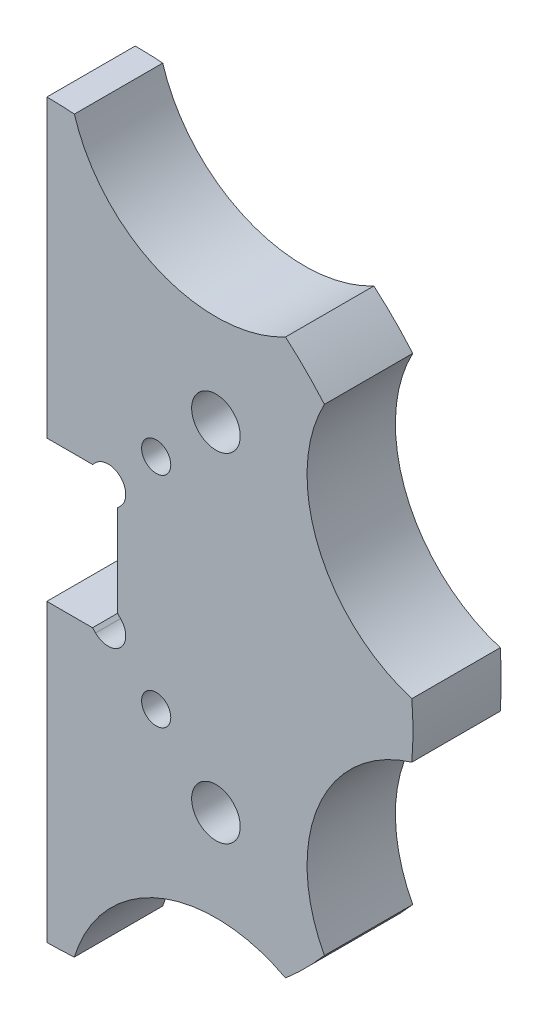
from build123d import *

# Parameters (mm, degrees)
ESQUISSE1_R             = 2.75
BOSS_EXTRU_1_DEPTH      = 10
TROU_TARAUD_M41_D       = 3.3
ENL_V_MAT_EXTRU_1_DEPTH = 60.429905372


with BuildPart() as part:
    # Esquisse1 → Boss.-Extru.1 (new body)
    with BuildSketch(Plane.XY):
        with BuildLine():
            Line((0, 41.424109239), (0, 8))
            Line((0, 8), (8, 8))
            Line((8, 8), (8, -8))
            Line((8, -8), (0, -8))
            Line((0, -8), (0, -41.424109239))
            ThreePointArc((0, -41.424109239), (1.557573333, -41.394815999), (3.112943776, -41.306977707))
            ThreePointArc((3.112943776, -41.306977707), (12.724224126, -30.718994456), (27.007260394, -31.409627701))
            ThreePointArc((27.007260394, -31.409627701), (29.291268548, -29.291268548), (31.409627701, -27.007260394))
            ThreePointArc((31.409627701, -27.007260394), (30.718994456, -12.724224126), (41.306977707, -3.112943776))
            ThreePointArc((41.306977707, -3.112943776), (41.424109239, 0), (41.306977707, 3.112943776))
            ThreePointArc((41.306977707, 3.112943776), (30.718994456, 12.724224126), (31.409627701, 27.007260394))
            ThreePointArc((31.409627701, 27.007260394), (29.291268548, 29.291268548), (27.007260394, 31.409627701))
            ThreePointArc((27.007260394, 31.409627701), (12.724224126, 30.718994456), (3.112943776, 41.306977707))
            ThreePointArc((3.112943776, 41.306977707), (1.557573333, 41.394815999), (0, 41.424109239))
        make_face()
        with Locations((19.134171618, 19.134171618)):
            Circle(ESQUISSE1_R, mode=Mode.SUBTRACT)
        with Locations((19.134171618, -19.134171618)):
            Circle(ESQUISSE1_R, mode=Mode.SUBTRACT)
    extrude(amount=BOSS_EXTRU_1_DEPTH)

    # Trou taraud_ M41 (through all)
    with Locations(Plane.XY.offset(10)):
        with Locations((12.374368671, 12.374368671), (12.374368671, -12.374368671)):
            Hole(TROU_TARAUD_M41_D / 2)

    # Esquisse5 → Enl_v. mat.-Extru.1 (cut, through all)
    with BuildSketch(Plane.XY.offset(10)):
        with BuildLine():
            Line((5.515432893, 8.343860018), (5.171572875, 8))
            Line((5.171572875, 8), (8, 5.171572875))
            Line((8, 5.171572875), (8.343860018, 5.515432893))
            ThreePointArc((8.343860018, 5.515432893), (8.343860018, 8.343860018), (5.515432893, 8.343860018))
        make_face()
        with BuildLine():
            Line((8, -5.171572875), (5.171572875, -8))
            Line((5.171572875, -8), (5.515432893, -8.343860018))
            ThreePointArc((5.515432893, -8.343860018), (8.343860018, -8.343860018), (8.343860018, -5.515432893))
            Line((8.343860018, -5.515432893), (8, -5.171572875))
        make_face()
    extrude(amount=-ENL_V_MAT_EXTRU_1_DEPTH, mode=Mode.SUBTRACT)


solid = part.part
